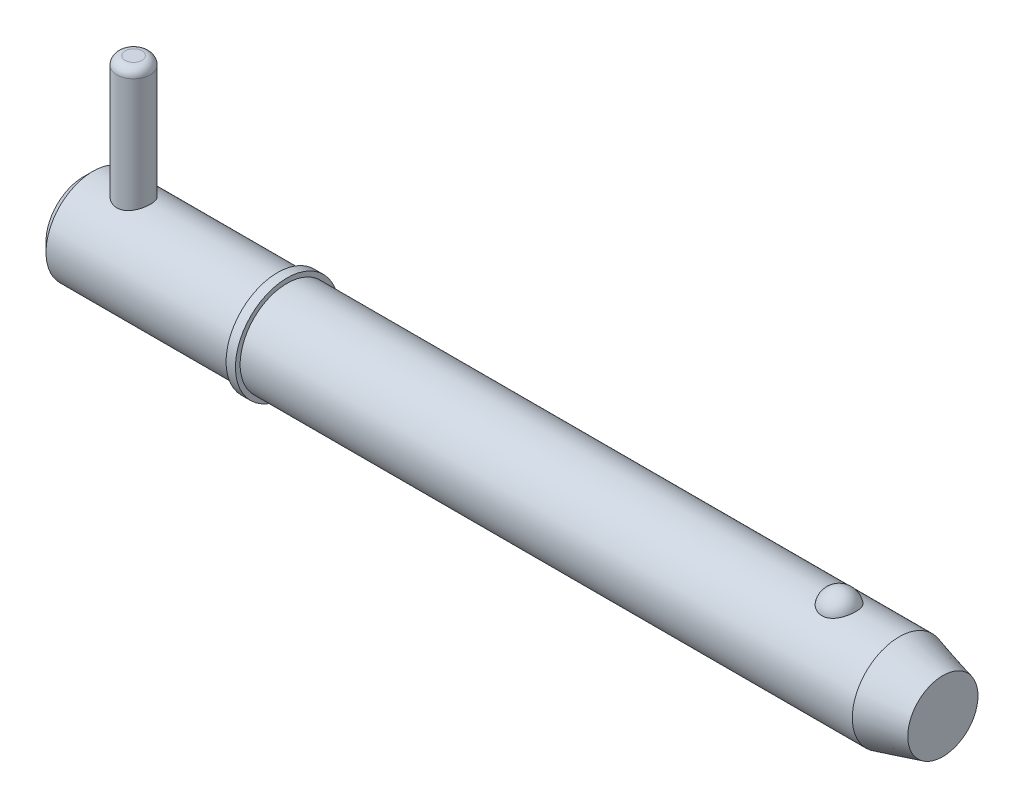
ISO-10303-21;
HEADER;
FILE_DESCRIPTION(('STEP AP214'),'2;1');
FILE_NAME('part.step','',(''),(''),'','','');
FILE_SCHEMA(('AUTOMOTIVE_DESIGN { 1 0 10303 214 1 1 1 1 }'));
ENDSEC;
DATA;
#1=APPLICATION_CONTEXT('core data for automotive mechanical design processes');
#2=APPLICATION_PROTOCOL_DEFINITION('international standard','automotive_design',2000,#1);
#3=PRODUCT_CONTEXT('',#1,'mechanical');
#4=PRODUCT('Part','Part','',(#3));
#5=PRODUCT_RELATED_PRODUCT_CATEGORY('part','',(#4));
#6=PRODUCT_DEFINITION_FORMATION('','',#4);
#7=PRODUCT_DEFINITION_CONTEXT('part definition',#1,'design');
#8=PRODUCT_DEFINITION('design','',#6,#7);
#9=PRODUCT_DEFINITION_SHAPE('','',#8);
#10=(LENGTH_UNIT() NAMED_UNIT(*) SI_UNIT(.MILLI.,.METRE.));
#11=(NAMED_UNIT(*) PLANE_ANGLE_UNIT() SI_UNIT($,.RADIAN.));
#12=(NAMED_UNIT(*) SI_UNIT($,.STERADIAN.) SOLID_ANGLE_UNIT());
#13=UNCERTAINTY_MEASURE_WITH_UNIT(LENGTH_MEASURE(1.E-05),#10,'distance_accuracy_value','');
#14=(GEOMETRIC_REPRESENTATION_CONTEXT(3) GLOBAL_UNCERTAINTY_ASSIGNED_CONTEXT((#13)) GLOBAL_UNIT_ASSIGNED_CONTEXT((#10,
#11,#12)) REPRESENTATION_CONTEXT('',''));
#15=CARTESIAN_POINT('',(0.,0.,0.));
#16=DIRECTION('',(0.,0.,1.));
#17=DIRECTION('',(1.,0.,0.));
#18=AXIS2_PLACEMENT_3D('',#15,#16,#17);
#19=CARTESIAN_POINT('',(5.94,19.845,0.));
#20=DIRECTION('',(0.,-1.,0.));
#21=DIRECTION('',(0.,0.,-1.));
#22=AXIS2_PLACEMENT_3D('',#19,#20,#21);
#23=CYLINDRICAL_SURFACE('',#22,1.98);
#24=CARTESIAN_POINT('',(5.94,-4.565,0.));
#25=DIRECTION('',(0.,1.,0.));
#26=DIRECTION('',(0.,0.,1.));
#27=AXIS2_PLACEMENT_3D('',#24,#25,#26);
#28=CIRCLE('',#27,1.98);
#29=CARTESIAN_POINT('',(5.94,-4.565,1.98));
#30=VERTEX_POINT('',#29);
#31=EDGE_CURVE('P0_E25',#30,#30,#28,.T.);
#32=ORIENTED_EDGE('',*,*,#31,.T.);
#33=EDGE_LOOP('',(#32));
#34=FACE_BOUND('',#33,.T.);
#35=CARTESIAN_POINT('',(5.94,18.855,0.));
#36=DIRECTION('',(0.,1.,0.));
#37=DIRECTION('',(0.,0.,1.));
#38=AXIS2_PLACEMENT_3D('',#35,#36,#37);
#39=CIRCLE('',#38,1.98);
#40=CARTESIAN_POINT('',(5.94,18.855,1.98));
#41=VERTEX_POINT('',#40);
#42=EDGE_CURVE('P0_E29',#41,#41,#39,.F.);
#43=ORIENTED_EDGE('',*,*,#42,.T.);
#44=EDGE_LOOP('',(#43));
#45=FACE_BOUND('',#44,.T.);
#46=ADVANCED_FACE('P0_F14',(#34,#45),#23,.T.);
#47=CARTESIAN_POINT('',(5.94,19.845,0.));
#48=DIRECTION('',(0.,1.,0.));
#49=DIRECTION('',(0.,0.,1.));
#50=AXIS2_PLACEMENT_3D('',#47,#48,#49);
#51=PLANE('',#50);
#52=CARTESIAN_POINT('',(5.94,19.845,0.));
#53=DIRECTION('',(0.,1.,0.));
#54=DIRECTION('',(0.,0.,1.));
#55=AXIS2_PLACEMENT_3D('',#52,#53,#54);
#56=CIRCLE('',#55,0.99);
#57=CARTESIAN_POINT('',(5.94,19.845,0.99));
#58=VERTEX_POINT('',#57);
#59=EDGE_CURVE('P0_E10',#58,#58,#56,.T.);
#60=ORIENTED_EDGE('',*,*,#59,.T.);
#61=EDGE_LOOP('',(#60));
#62=FACE_BOUND('',#61,.T.);
#63=ADVANCED_FACE('P0_F46',(#62),#51,.T.);
#64=CARTESIAN_POINT('',(5.94,-5.555,0.));
#65=DIRECTION('',(0.,1.,0.));
#66=DIRECTION('',(0.,0.,1.));
#67=AXIS2_PLACEMENT_3D('',#64,#65,#66);
#68=PLANE('',#67);
#69=CARTESIAN_POINT('',(5.94,-5.555,0.));
#70=DIRECTION('',(0.,1.,0.));
#71=DIRECTION('',(0.,0.,1.));
#72=AXIS2_PLACEMENT_3D('',#69,#70,#71);
#73=CIRCLE('',#72,0.99);
#74=CARTESIAN_POINT('',(5.94,-5.555,0.99));
#75=VERTEX_POINT('',#74);
#76=EDGE_CURVE('P0_E21',#75,#75,#73,.F.);
#77=ORIENTED_EDGE('',*,*,#76,.T.);
#78=EDGE_LOOP('',(#77));
#79=FACE_BOUND('',#78,.T.);
#80=ADVANCED_FACE('P0_F43',(#79),#68,.F.);
#81=CARTESIAN_POINT('',(5.94,-4.565,0.));
#82=DIRECTION('',(0.,1.,0.));
#83=DIRECTION('',(0.,0.,1.));
#84=AXIS2_PLACEMENT_3D('',#81,#82,#83);
#85=DEGENERATE_TOROIDAL_SURFACE('',#84,0.99,0.99,.T.);
#86=ORIENTED_EDGE('',*,*,#76,.F.);
#87=EDGE_LOOP('',(#86));
#88=FACE_BOUND('',#87,.T.);
#89=ORIENTED_EDGE('',*,*,#31,.F.);
#90=EDGE_LOOP('',(#89));
#91=FACE_BOUND('',#90,.T.);
#92=ADVANCED_FACE('P0_F38',(#88,#91),#85,.T.);
#93=CARTESIAN_POINT('',(5.94,18.855,0.));
#94=DIRECTION('',(0.,1.,0.));
#95=DIRECTION('',(0.,0.,1.));
#96=AXIS2_PLACEMENT_3D('',#93,#94,#95);
#97=DEGENERATE_TOROIDAL_SURFACE('',#96,0.99,0.99,.T.);
#98=ORIENTED_EDGE('',*,*,#42,.F.);
#99=EDGE_LOOP('',(#98));
#100=FACE_BOUND('',#99,.T.);
#101=ORIENTED_EDGE('',*,*,#59,.F.);
#102=EDGE_LOOP('',(#101));
#103=FACE_BOUND('',#102,.T.);
#104=ADVANCED_FACE('P0_F16',(#100,#103),#97,.T.);
#105=CLOSED_SHELL('',(#46,#63,#80,#92,#104));
#106=MANIFOLD_SOLID_BREP('P0_B1',#105);
#107=CARTESIAN_POINT('',(0.,0.,0.));
#108=DIRECTION('',(1.,0.,0.));
#109=DIRECTION('',(0.,0.,-1.));
#110=AXIS2_PLACEMENT_3D('',#107,#108,#109);
#111=CYLINDRICAL_SURFACE('',#110,5.555);
#112=CARTESIAN_POINT('',(96.7171144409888,0.,0.));
#113=DIRECTION('',(1.,0.,0.));
#114=DIRECTION('',(0.,0.,-1.));
#115=AXIS2_PLACEMENT_3D('',#112,#113,#114);
#116=CIRCLE('',#115,5.555);
#117=CARTESIAN_POINT('',(96.7171144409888,0.,-5.555));
#118=VERTEX_POINT('',#117);
#119=EDGE_CURVE('P1_E81',#118,#118,#116,.T.);
#120=ORIENTED_EDGE('',*,*,#119,.F.);
#121=EDGE_LOOP('',(#120));
#122=FACE_BOUND('',#121,.T.);
#123=CARTESIAN_POINT('',(24.13,0.,0.));
#124=DIRECTION('',(1.,0.,0.));
#125=DIRECTION('',(0.,0.,-1.));
#126=AXIS2_PLACEMENT_3D('',#123,#124,#125);
#127=CIRCLE('',#126,5.555);
#128=CARTESIAN_POINT('',(24.13,0.,-5.555));
#129=VERTEX_POINT('',#128);
#130=EDGE_CURVE('P1_E85',#129,#129,#127,.T.);
#131=ORIENTED_EDGE('',*,*,#130,.T.);
#132=EDGE_LOOP('',(#131));
#133=FACE_BOUND('',#132,.T.);
#134=CARTESIAN_POINT('',(89.5986264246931,5.16741224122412,2.03859650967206));
#135=CARTESIAN_POINT('',(89.4929492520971,5.16740893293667,2.03859990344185));
#136=CARTESIAN_POINT('',(89.3872989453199,5.17079470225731,2.03008306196));
#137=CARTESIAN_POINT('',(89.1791419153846,5.18392795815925,1.99630721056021));
#138=CARTESIAN_POINT('',(89.0766344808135,5.19367399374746,1.97105201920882));
#139=CARTESIAN_POINT('',(88.8777710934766,5.21839168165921,1.90463997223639));
#140=CARTESIAN_POINT('',(88.7814064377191,5.23335573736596,1.86350622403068));
#141=CARTESIAN_POINT('',(88.5970804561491,5.26688076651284,1.76652592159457));
#142=CARTESIAN_POINT('',(88.5091207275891,5.28544242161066,1.71067657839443));
#143=CARTESIAN_POINT('',(88.341265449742,5.32479845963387,1.58399959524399));
#144=CARTESIAN_POINT('',(88.2616656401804,5.34564089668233,1.51279545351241));
#145=CARTESIAN_POINT('',(88.1151290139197,5.38697258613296,1.3582858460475));
#146=CARTESIAN_POINT('',(88.048194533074,5.40746177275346,1.27497815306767));
#147=CARTESIAN_POINT('',(87.9256103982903,5.44694508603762,1.09440293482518));
#148=CARTESIAN_POINT('',(87.870598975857,5.46583143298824,0.996677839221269));
#149=CARTESIAN_POINT('',(87.7769376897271,5.49908030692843,0.792961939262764));
#150=CARTESIAN_POINT('',(87.7382894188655,5.513442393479,0.686970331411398));
#151=CARTESIAN_POINT('',(87.6776807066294,5.536358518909,0.468019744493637));
#152=CARTESIAN_POINT('',(87.6559725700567,5.54482455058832,0.354981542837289));
#153=CARTESIAN_POINT('',(87.6306362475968,5.55473324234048,0.126595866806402));
#154=CARTESIAN_POINT('',(87.6270077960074,5.55617600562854,0.0112484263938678));
#155=CARTESIAN_POINT('',(87.6378817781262,5.55189984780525,-0.218011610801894));
#156=CARTESIAN_POINT('',(87.6523151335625,5.54620821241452,-0.331928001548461));
#157=CARTESIAN_POINT('',(87.698903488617,5.52828920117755,-0.555544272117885));
#158=CARTESIAN_POINT('',(87.7310588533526,5.51606169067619,-0.665244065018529));
#159=CARTESIAN_POINT('',(87.8124883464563,5.48630779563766,-0.877469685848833));
#160=CARTESIAN_POINT('',(87.861781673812,5.4687754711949,-0.979987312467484));
#161=CARTESIAN_POINT('',(87.9764785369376,5.43024700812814,-1.17486975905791));
#162=CARTESIAN_POINT('',(88.0418831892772,5.40925062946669,-1.26723387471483));
#163=CARTESIAN_POINT('',(88.1875712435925,5.36600927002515,-1.43940133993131));
#164=CARTESIAN_POINT('',(88.2678859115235,5.34376173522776,-1.51917763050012));
#165=CARTESIAN_POINT('',(88.4414520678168,5.30057971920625,-1.66360338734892));
#166=CARTESIAN_POINT('',(88.534702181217,5.27964509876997,-1.72825445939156));
#167=CARTESIAN_POINT('',(88.7293939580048,5.24205250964,-1.83909478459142));
#168=CARTESIAN_POINT('',(88.8305900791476,5.22530519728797,-1.88568407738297));
#169=CARTESIAN_POINT('',(89.0401552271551,5.1975091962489,-1.96100802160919));
#170=CARTESIAN_POINT('',(89.1485215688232,5.1864583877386,-1.98974931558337));
#171=CARTESIAN_POINT('',(89.3634989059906,5.17184410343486,-2.02742262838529));
#172=CARTESIAN_POINT('',(89.469925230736,5.1679328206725,-2.03727608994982));
#173=CARTESIAN_POINT('',(89.6829925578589,5.16698995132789,-2.03966777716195));
#174=CARTESIAN_POINT('',(89.7896335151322,5.16995704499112,-2.03220932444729));
#175=CARTESIAN_POINT('',(89.9967730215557,5.18222383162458,-2.00071170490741));
#176=CARTESIAN_POINT('',(90.0973599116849,5.19133213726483,-1.97717337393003));
#177=CARTESIAN_POINT('',(90.2930141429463,5.21467637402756,-1.91475248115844));
#178=CARTESIAN_POINT('',(90.3880810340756,5.22891272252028,-1.87586867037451));
#179=CARTESIAN_POINT('',(90.5723711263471,5.26137066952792,-1.7828271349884));
#180=CARTESIAN_POINT('',(90.6614190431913,5.27967329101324,-1.72835124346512));
#181=CARTESIAN_POINT('',(90.8292880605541,5.3181741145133,-1.6059748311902));
#182=CARTESIAN_POINT('',(90.9081068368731,5.33837274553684,-1.53807126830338));
#183=CARTESIAN_POINT('',(91.0575156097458,5.37968287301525,-1.38688970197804));
#184=CARTESIAN_POINT('',(91.1275058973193,5.40079011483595,-1.30301744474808));
#185=CARTESIAN_POINT('',(91.2530125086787,5.44074401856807,-1.12458170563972));
#186=CARTESIAN_POINT('',(91.3085262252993,5.4595902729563,-1.03001630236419));
#187=CARTESIAN_POINT('',(91.4055507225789,5.49369849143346,-0.829439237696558));
#188=CARTESIAN_POINT('',(91.4465483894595,5.50882422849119,-0.723155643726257));
#189=CARTESIAN_POINT('',(91.5111250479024,5.53310911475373,-0.504772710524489));
#190=CARTESIAN_POINT('',(91.5347036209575,5.54226812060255,-0.392673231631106));
#191=CARTESIAN_POINT('',(91.564013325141,5.55370358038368,-0.165459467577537));
#192=CARTESIAN_POINT('',(91.5696884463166,5.55595843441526,-0.0503368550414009));
#193=CARTESIAN_POINT('',(91.562916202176,5.55329317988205,0.179288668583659));
#194=CARTESIAN_POINT('',(91.5504690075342,5.54837313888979,0.293791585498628));
#195=CARTESIAN_POINT('',(91.5077798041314,5.53189037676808,0.518526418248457));
#196=CARTESIAN_POINT('',(91.477598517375,5.5203503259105,0.628771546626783));
#197=CARTESIAN_POINT('',(91.4000962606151,5.49182453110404,0.842318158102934));
#198=CARTESIAN_POINT('',(91.3527743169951,5.47483847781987,0.945619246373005));
#199=CARTESIAN_POINT('',(91.2417204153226,5.43710633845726,1.14281571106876));
#200=CARTESIAN_POINT('',(91.1779215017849,5.41634501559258,1.23667048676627));
#201=CARTESIAN_POINT('',(91.0353577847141,5.37334572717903,1.41185243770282));
#202=CARTESIAN_POINT('',(90.9565932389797,5.35110778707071,1.4931798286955));
#203=CARTESIAN_POINT('',(90.7864234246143,5.30779474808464,1.64049162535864));
#204=CARTESIAN_POINT('',(90.6951002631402,5.28671324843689,1.70656877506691));
#205=CARTESIAN_POINT('',(90.5017390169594,5.24804852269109,1.82201372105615));
#206=CARTESIAN_POINT('',(90.3997005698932,5.23046541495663,1.87138095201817));
#207=CARTESIAN_POINT('',(90.1836187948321,5.20042692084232,1.95335298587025));
#208=CARTESIAN_POINT('',(90.069260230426,5.18820192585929,1.98521734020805));
#209=CARTESIAN_POINT('',(89.8361307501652,5.17169804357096,2.02783294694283));
#210=CARTESIAN_POINT('',(89.7173616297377,5.16741595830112,2.03859269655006));
#211=CARTESIAN_POINT('',(89.5986264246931,5.16741224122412,2.03859650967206));
#212=B_SPLINE_CURVE_WITH_KNOTS('',3,(#134,#135,#136,#137,#138,#139,#140,#141,#142,#143,#144,
#145,#146,#147,#148,#149,#150,#151,#152,#153,#154,#155,#156,#157,#158,#159,#160,#161,#162,#163,
#164,#165,#166,#167,#168,#169,#170,#171,#172,#173,#174,#175,#176,#177,#178,#179,#180,#181,#182,
#183,#184,#185,#186,#187,#188,#189,#190,#191,#192,#193,#194,#195,#196,#197,#198,#199,#200,#201,
#202,#203,#204,#205,#206,#207,#208,#209,#210,#211),.UNSPECIFIED.,.T.,.F.,(4,2,2,2,2,2,2,2,2,2,2,
2,2,2,2,2,2,2,2,2,2,2,2,2,2,2,2,2,2,2,2,2,2,2,2,2,2,2,4),(0.,0.316595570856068,
0.633118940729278,0.949183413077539,1.26530783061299,1.59030762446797,1.91536729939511,
2.25495824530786,2.5945822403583,2.93917283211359,3.28375835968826,3.62703002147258,
3.97030875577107,4.31397329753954,4.65766166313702,5.0020790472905,5.34645984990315,
5.68270547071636,6.01882587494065,6.33808403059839,6.65728093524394,6.96696376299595,
7.27667180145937,7.59321535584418,7.90983070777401,8.24210387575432,8.57443684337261,
8.91755896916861,9.26068933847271,9.60489211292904,9.94909164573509,10.2921194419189,
10.6351667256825,10.9796305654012,11.3240884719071,11.6663928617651,12.0087088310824,
12.3645679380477,12.7202837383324),.UNSPECIFIED.);
#213=CARTESIAN_POINT('',(89.5986264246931,5.16741224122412,2.03859650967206));
#214=VERTEX_POINT('',#213);
#215=EDGE_CURVE('P1_E35',#214,#214,#212,.T.);
#216=ORIENTED_EDGE('',*,*,#215,.T.);
#217=EDGE_LOOP('',(#216));
#218=FACE_BOUND('',#217,.T.);
#219=ADVANCED_FACE('P1_F13',(#122,#133,#218),#111,.T.);
#220=CARTESIAN_POINT('',(0.,0.,0.));
#221=DIRECTION('',(-1.,0.,0.));
#222=DIRECTION('',(0.,0.,1.));
#223=AXIS2_PLACEMENT_3D('',#220,#221,#222);
#224=PLANE('',#223);
#225=CARTESIAN_POINT('',(0.,0.,0.));
#226=DIRECTION('',(1.,0.,0.));
#227=DIRECTION('',(0.,0.,-1.));
#228=AXIS2_PLACEMENT_3D('',#225,#226,#227);
#229=CIRCLE('',#228,4.444);
#230=CARTESIAN_POINT('',(0.,0.,-4.444));
#231=VERTEX_POINT('',#230);
#232=EDGE_CURVE('P1_E9',#231,#231,#229,.T.);
#233=ORIENTED_EDGE('',*,*,#232,.F.);
#234=EDGE_LOOP('',(#233));
#235=FACE_BOUND('',#234,.T.);
#236=ADVANCED_FACE('P1_F15',(#235),#224,.T.);
#237=CARTESIAN_POINT('',(1.111,0.,0.));
#238=DIRECTION('',(1.,0.,0.));
#239=DIRECTION('',(0.,0.,-1.));
#240=AXIS2_PLACEMENT_3D('',#237,#238,#239);
#241=CONICAL_SURFACE('',#240,5.555,0.78539816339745);
#242=ORIENTED_EDGE('',*,*,#232,.T.);
#243=EDGE_LOOP('',(#242));
#244=FACE_BOUND('',#243,.T.);
#245=CARTESIAN_POINT('',(1.111,0.,0.));
#246=DIRECTION('',(1.,0.,0.));
#247=DIRECTION('',(0.,0.,-1.));
#248=AXIS2_PLACEMENT_3D('',#245,#246,#247);
#249=CIRCLE('',#248,5.555);
#250=CARTESIAN_POINT('',(1.111,0.,-5.555));
#251=VERTEX_POINT('',#250);
#252=EDGE_CURVE('P1_E26',#251,#251,#249,.T.);
#253=ORIENTED_EDGE('',*,*,#252,.F.);
#254=EDGE_LOOP('',(#253));
#255=FACE_BOUND('',#254,.T.);
#256=ADVANCED_FACE('P1_F77',(#244,#255),#241,.T.);
#257=CARTESIAN_POINT('',(0.,0.,0.));
#258=DIRECTION('',(1.,0.,0.));
#259=DIRECTION('',(0.,0.,-1.));
#260=AXIS2_PLACEMENT_3D('',#257,#258,#259);
#261=CYLINDRICAL_SURFACE('',#260,5.555);
#262=CARTESIAN_POINT('',(5.94,-5.19014691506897,1.98));
#263=CARTESIAN_POINT('',(5.83264687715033,-5.19014494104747,1.98000226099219));
#264=CARTESIAN_POINT('',(5.7253094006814,-5.19351395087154,1.97123988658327));
#265=CARTESIAN_POINT('',(5.51384517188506,-5.20654291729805,1.93656219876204));
#266=CARTESIAN_POINT('',(5.40971858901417,-5.21620320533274,1.91064598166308));
#267=CARTESIAN_POINT('',(5.20778082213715,-5.24058443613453,1.84271148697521));
#268=CARTESIAN_POINT('',(5.10995634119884,-5.25529427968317,1.80072850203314));
#269=CARTESIAN_POINT('',(4.92270352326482,-5.28810012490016,1.70197537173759));
#270=CARTESIAN_POINT('',(4.83327743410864,-5.3061970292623,1.64520128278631));
#271=CARTESIAN_POINT('',(4.66135184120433,-5.34464714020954,1.51575187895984));
#272=CARTESIAN_POINT('',(4.57928277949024,-5.36506222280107,1.44252311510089));
#273=CARTESIAN_POINT('',(4.42829115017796,-5.40532920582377,1.28342047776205));
#274=CARTESIAN_POINT('',(4.35937105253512,-5.42518099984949,1.19754423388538));
#275=CARTESIAN_POINT('',(4.23461605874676,-5.46281133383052,1.01237205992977));
#276=CARTESIAN_POINT('',(4.17924129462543,-5.48050875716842,0.912748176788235));
#277=CARTESIAN_POINT('',(4.0862117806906,-5.51109938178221,0.70485824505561));
#278=CARTESIAN_POINT('',(4.0485515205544,-5.52399407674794,0.596594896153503));
#279=CARTESIAN_POINT('',(3.99350662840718,-5.54308759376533,0.379019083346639));
#280=CARTESIAN_POINT('',(3.97538263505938,-5.54952987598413,0.269915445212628));
#281=CARTESIAN_POINT('',(3.95756405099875,-5.55586205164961,0.0500378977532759));
#282=CARTESIAN_POINT('',(3.95786404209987,-5.55575387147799,-0.060735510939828));
#283=CARTESIAN_POINT('',(3.97643665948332,-5.54915684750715,-0.275539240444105));
#284=CARTESIAN_POINT('',(3.99390415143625,-5.54295384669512,-0.379649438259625));
#285=CARTESIAN_POINT('',(4.0449721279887,-5.52523170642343,-0.583350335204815));
#286=CARTESIAN_POINT('',(4.07857373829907,-5.51371219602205,-0.682940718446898));
#287=CARTESIAN_POINT('',(4.16137312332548,-5.4863099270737,-0.876423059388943));
#288=CARTESIAN_POINT('',(4.2107826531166,-5.47036834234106,-0.970215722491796));
#289=CARTESIAN_POINT('',(4.32361427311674,-5.43575653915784,-1.1484017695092));
#290=CARTESIAN_POINT('',(4.38704062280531,-5.41708549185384,-1.23279228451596));
#291=CARTESIAN_POINT('',(4.53006791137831,-5.37778429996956,-1.39454579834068));
#292=CARTESIAN_POINT('',(4.61035105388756,-5.35710277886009,-1.4712940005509));
#293=CARTESIAN_POINT('',(4.78279835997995,-5.31692766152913,-1.6104545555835));
#294=CARTESIAN_POINT('',(4.874964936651,-5.29743430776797,-1.67286398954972));
#295=CARTESIAN_POINT('',(5.07076688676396,-5.26153775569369,-1.78259698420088));
#296=CARTESIAN_POINT('',(5.17458163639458,-5.24519780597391,-1.8296227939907));
#297=CARTESIAN_POINT('',(5.38938990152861,-5.21818744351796,-1.90530278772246));
#298=CARTESIAN_POINT('',(5.50037985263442,-5.20751423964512,-1.93396601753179));
#299=CARTESIAN_POINT('',(5.72036376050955,-5.19369176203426,-1.97077654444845));
#300=CARTESIAN_POINT('',(5.82917370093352,-5.19018851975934,-1.97989015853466));
#301=CARTESIAN_POINT('',(6.04680100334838,-5.19010609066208,-1.98010779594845));
#302=CARTESIAN_POINT('',(6.15561835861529,-5.19352540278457,-1.97121572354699));
#303=CARTESIAN_POINT('',(6.36548036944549,-5.20654623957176,-1.93654727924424));
#304=CARTESIAN_POINT('',(6.46666051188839,-5.21588705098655,-1.91148218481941));
#305=CARTESIAN_POINT('',(6.66334537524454,-5.23939939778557,-1.84605494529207));
#306=CARTESIAN_POINT('',(6.75884899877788,-5.25357186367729,-1.8056898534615));
#307=CARTESIAN_POINT('',(6.94517989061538,-5.28576258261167,-1.70921153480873));
#308=CARTESIAN_POINT('',(7.03572661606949,-5.30389804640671,-1.65259670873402));
#309=CARTESIAN_POINT('',(7.20638087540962,-5.34176077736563,-1.52577523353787));
#310=CARTESIAN_POINT('',(7.28648490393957,-5.36148857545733,-1.45556404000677));
#311=CARTESIAN_POINT('',(7.43864697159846,-5.40165494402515,-1.2988614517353));
#312=CARTESIAN_POINT('',(7.50999887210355,-5.42207106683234,-1.21167640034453));
#313=CARTESIAN_POINT('',(7.63712639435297,-5.46023601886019,-1.026066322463));
#314=CARTESIAN_POINT('',(7.69290228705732,-5.47798489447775,-0.927641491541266));
#315=CARTESIAN_POINT('',(7.78684673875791,-5.50876590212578,-0.722633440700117));
#316=CARTESIAN_POINT('',(7.82510508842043,-5.52182201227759,-0.616095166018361));
#317=CARTESIAN_POINT('',(7.88297051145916,-5.54184206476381,-0.397530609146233));
#318=CARTESIAN_POINT('',(7.90258540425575,-5.5488085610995,-0.285506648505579));
#319=CARTESIAN_POINT('',(7.9218262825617,-5.55564472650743,-0.065566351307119));
#320=CARTESIAN_POINT('',(7.92245987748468,-5.55587212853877,0.0422515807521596));
#321=CARTESIAN_POINT('',(7.90626329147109,-5.55011340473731,0.256387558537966));
#322=CARTESIAN_POINT('',(7.88943488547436,-5.54412791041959,0.362705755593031));
#323=CARTESIAN_POINT('',(7.83948457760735,-5.52676548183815,0.568649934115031));
#324=CARTESIAN_POINT('',(7.8067003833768,-5.51550046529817,0.668367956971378));
#325=CARTESIAN_POINT('',(7.72609369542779,-5.48874437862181,0.860911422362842));
#326=CARTESIAN_POINT('',(7.67826838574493,-5.47325251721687,0.953735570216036));
#327=CARTESIAN_POINT('',(7.56675024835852,-5.43884382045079,1.13391068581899));
#328=CARTESIAN_POINT('',(7.50249968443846,-5.41981485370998,1.22089468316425));
#329=CARTESIAN_POINT('',(7.36086495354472,-5.38069275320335,1.38316665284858));
#330=CARTESIAN_POINT('',(7.28347630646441,-5.36059925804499,1.45845061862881));
#331=CARTESIAN_POINT('',(7.11347587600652,-5.32048380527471,1.59876646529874));
#332=CARTESIAN_POINT('',(7.02032386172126,-5.30050854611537,1.66315951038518));
#333=CARTESIAN_POINT('',(6.82388804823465,-5.26398994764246,1.77536801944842));
#334=CARTESIAN_POINT('',(6.7206049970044,-5.24744635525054,1.82318470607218));
#335=CARTESIAN_POINT('',(6.50639706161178,-5.21987969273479,1.90068230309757));
#336=CARTESIAN_POINT('',(6.3954529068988,-5.20887116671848,1.93031547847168));
#337=CARTESIAN_POINT('',(6.16966522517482,-5.19400760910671,1.96996824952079));
#338=CARTESIAN_POINT('',(6.05482366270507,-5.19014902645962,1.97999758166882));
#339=CARTESIAN_POINT('',(5.94,-5.19014691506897,1.98));
#340=B_SPLINE_CURVE_WITH_KNOTS('',3,(#262,#263,#264,#265,#266,#267,#268,#269,#270,#271,#272,
#273,#274,#275,#276,#277,#278,#279,#280,#281,#282,#283,#284,#285,#286,#287,#288,#289,#290,#291,
#292,#293,#294,#295,#296,#297,#298,#299,#300,#301,#302,#303,#304,#305,#306,#307,#308,#309,#310,
#311,#312,#313,#314,#315,#316,#317,#318,#319,#320,#321,#322,#323,#324,#325,#326,#327,#328,#329,
#330,#331,#332,#333,#334,#335,#336,#337,#338,#339),.UNSPECIFIED.,.T.,.F.,(4,2,2,2,2,2,2,2,2,2,2,
2,2,2,2,2,2,2,2,2,2,2,2,2,2,2,2,2,2,2,2,2,2,2,2,2,2,2,4),(0.,0.321632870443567,
0.643282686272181,0.964229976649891,1.28526292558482,1.61937087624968,1.9535415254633,
2.29784481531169,2.64204093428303,2.97269632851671,3.30325448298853,3.61901541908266,
3.93479838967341,4.25500220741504,4.57530346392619,4.91268648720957,5.25013812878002,
5.59378026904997,5.93725299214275,6.26331481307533,6.58930593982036,6.90185604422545,
7.21446637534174,7.53801472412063,7.86167140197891,8.20353561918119,8.54539388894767,
8.88547970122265,9.22542281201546,9.54728637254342,9.86911722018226,10.1844146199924,
10.4997710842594,10.827730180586,11.1558013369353,11.499115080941,11.8424034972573,
12.1865892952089,12.5306041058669),.UNSPECIFIED.);
#341=CARTESIAN_POINT('',(5.94,-5.19014691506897,1.98));
#342=VERTEX_POINT('',#341);
#343=EDGE_CURVE('P1_E17',#342,#342,#340,.T.);
#344=ORIENTED_EDGE('',*,*,#343,.F.);
#345=EDGE_LOOP('',(#344));
#346=FACE_BOUND('',#345,.T.);
#347=CARTESIAN_POINT('',(5.94,5.19014691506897,1.98));
#348=CARTESIAN_POINT('',(6.04735312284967,5.19014494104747,1.98000226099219));
#349=CARTESIAN_POINT('',(6.1546905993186,5.19351395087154,1.97123988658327));
#350=CARTESIAN_POINT('',(6.36615482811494,5.20654291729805,1.93656219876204));
#351=CARTESIAN_POINT('',(6.47028141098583,5.21620320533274,1.91064598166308));
#352=CARTESIAN_POINT('',(6.67221917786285,5.24058443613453,1.84271148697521));
#353=CARTESIAN_POINT('',(6.77004365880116,5.25529427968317,1.80072850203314));
#354=CARTESIAN_POINT('',(6.95729647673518,5.28810012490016,1.70197537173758));
#355=CARTESIAN_POINT('',(7.04672256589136,5.3061970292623,1.64520128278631));
#356=CARTESIAN_POINT('',(7.21864815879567,5.34464714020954,1.51575187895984));
#357=CARTESIAN_POINT('',(7.30071722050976,5.36506222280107,1.44252311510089));
#358=CARTESIAN_POINT('',(7.45170884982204,5.40532920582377,1.28342047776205));
#359=CARTESIAN_POINT('',(7.52062894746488,5.42518099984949,1.19754423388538));
#360=CARTESIAN_POINT('',(7.64538394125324,5.46281133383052,1.01237205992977));
#361=CARTESIAN_POINT('',(7.70075870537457,5.48050875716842,0.912748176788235));
#362=CARTESIAN_POINT('',(7.7937882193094,5.51109938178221,0.704858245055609));
#363=CARTESIAN_POINT('',(7.8314484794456,5.52399407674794,0.596594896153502));
#364=CARTESIAN_POINT('',(7.88649337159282,5.54308759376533,0.379019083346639));
#365=CARTESIAN_POINT('',(7.90461736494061,5.54952987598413,0.269915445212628));
#366=CARTESIAN_POINT('',(7.92243594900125,5.55586205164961,0.0500378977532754));
#367=CARTESIAN_POINT('',(7.92213595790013,5.55575387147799,-0.0607355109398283));
#368=CARTESIAN_POINT('',(7.90356334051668,5.54915684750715,-0.275539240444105));
#369=CARTESIAN_POINT('',(7.88609584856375,5.54295384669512,-0.379649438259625));
#370=CARTESIAN_POINT('',(7.8350278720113,5.52523170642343,-0.583350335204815));
#371=CARTESIAN_POINT('',(7.80142626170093,5.51371219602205,-0.682940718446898));
#372=CARTESIAN_POINT('',(7.71862687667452,5.4863099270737,-0.876423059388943));
#373=CARTESIAN_POINT('',(7.6692173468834,5.47036834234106,-0.970215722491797));
#374=CARTESIAN_POINT('',(7.55638572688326,5.43575653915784,-1.1484017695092));
#375=CARTESIAN_POINT('',(7.49295937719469,5.41708549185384,-1.23279228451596));
#376=CARTESIAN_POINT('',(7.34993208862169,5.37778429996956,-1.39454579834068));
#377=CARTESIAN_POINT('',(7.26964894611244,5.35710277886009,-1.4712940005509));
#378=CARTESIAN_POINT('',(7.09720164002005,5.31692766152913,-1.6104545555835));
#379=CARTESIAN_POINT('',(7.00503506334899,5.29743430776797,-1.67286398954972));
#380=CARTESIAN_POINT('',(6.80923311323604,5.26153775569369,-1.78259698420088));
#381=CARTESIAN_POINT('',(6.70541836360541,5.24519780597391,-1.8296227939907));
#382=CARTESIAN_POINT('',(6.49061009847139,5.21818744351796,-1.90530278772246));
#383=CARTESIAN_POINT('',(6.37962014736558,5.20751423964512,-1.93396601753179));
#384=CARTESIAN_POINT('',(6.15963623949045,5.19369176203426,-1.97077654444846));
#385=CARTESIAN_POINT('',(6.05082629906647,5.19018851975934,-1.97989015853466));
#386=CARTESIAN_POINT('',(5.83319899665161,5.19010609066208,-1.98010779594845));
#387=CARTESIAN_POINT('',(5.7243816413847,5.19352540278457,-1.97121572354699));
#388=CARTESIAN_POINT('',(5.5145196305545,5.20654623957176,-1.93654727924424));
#389=CARTESIAN_POINT('',(5.4133394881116,5.21588705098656,-1.91148218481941));
#390=CARTESIAN_POINT('',(5.21665462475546,5.23939939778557,-1.84605494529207));
#391=CARTESIAN_POINT('',(5.12115100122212,5.25357186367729,-1.8056898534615));
#392=CARTESIAN_POINT('',(4.93482010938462,5.28576258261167,-1.70921153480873));
#393=CARTESIAN_POINT('',(4.84427338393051,5.30389804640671,-1.65259670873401));
#394=CARTESIAN_POINT('',(4.67361912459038,5.34176077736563,-1.52577523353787));
#395=CARTESIAN_POINT('',(4.59351509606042,5.36148857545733,-1.45556404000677));
#396=CARTESIAN_POINT('',(4.44135302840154,5.40165494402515,-1.2988614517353));
#397=CARTESIAN_POINT('',(4.37000112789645,5.42207106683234,-1.21167640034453));
#398=CARTESIAN_POINT('',(4.24287360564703,5.46023601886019,-1.026066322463));
#399=CARTESIAN_POINT('',(4.18709771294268,5.47798489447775,-0.927641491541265));
#400=CARTESIAN_POINT('',(4.09315326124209,5.50876590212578,-0.722633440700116));
#401=CARTESIAN_POINT('',(4.05489491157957,5.52182201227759,-0.61609516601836));
#402=CARTESIAN_POINT('',(3.99702948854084,5.54184206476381,-0.397530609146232));
#403=CARTESIAN_POINT('',(3.97741459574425,5.5488085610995,-0.285506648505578));
#404=CARTESIAN_POINT('',(3.9581737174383,5.55564472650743,-0.0655663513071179));
#405=CARTESIAN_POINT('',(3.95754012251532,5.55587212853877,0.0422515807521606));
#406=CARTESIAN_POINT('',(3.97373670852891,5.55011340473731,0.256387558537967));
#407=CARTESIAN_POINT('',(3.99056511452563,5.54412791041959,0.362705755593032));
#408=CARTESIAN_POINT('',(4.04051542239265,5.52676548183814,0.568649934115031));
#409=CARTESIAN_POINT('',(4.07329961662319,5.51550046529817,0.668367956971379));
#410=CARTESIAN_POINT('',(4.15390630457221,5.48874437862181,0.860911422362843));
#411=CARTESIAN_POINT('',(4.20173161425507,5.47325251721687,0.953735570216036));
#412=CARTESIAN_POINT('',(4.31324975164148,5.43884382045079,1.13391068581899));
#413=CARTESIAN_POINT('',(4.37750031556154,5.41981485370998,1.22089468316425));
#414=CARTESIAN_POINT('',(4.51913504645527,5.38069275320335,1.38316665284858));
#415=CARTESIAN_POINT('',(4.59652369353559,5.36059925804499,1.45845061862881));
#416=CARTESIAN_POINT('',(4.76652412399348,5.32048380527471,1.59876646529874));
#417=CARTESIAN_POINT('',(4.85967613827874,5.30050854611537,1.66315951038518));
#418=CARTESIAN_POINT('',(5.05611195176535,5.26398994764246,1.77536801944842));
#419=CARTESIAN_POINT('',(5.1593950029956,5.24744635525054,1.82318470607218));
#420=CARTESIAN_POINT('',(5.37360293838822,5.21987969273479,1.90068230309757));
#421=CARTESIAN_POINT('',(5.4845470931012,5.20887116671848,1.93031547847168));
#422=CARTESIAN_POINT('',(5.71033477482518,5.19400760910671,1.96996824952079));
#423=CARTESIAN_POINT('',(5.82517633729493,5.19014902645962,1.97999758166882));
#424=CARTESIAN_POINT('',(5.94,5.19014691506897,1.98));
#425=B_SPLINE_CURVE_WITH_KNOTS('',3,(#347,#348,#349,#350,#351,#352,#353,#354,#355,#356,#357,
#358,#359,#360,#361,#362,#363,#364,#365,#366,#367,#368,#369,#370,#371,#372,#373,#374,#375,#376,
#377,#378,#379,#380,#381,#382,#383,#384,#385,#386,#387,#388,#389,#390,#391,#392,#393,#394,#395,
#396,#397,#398,#399,#400,#401,#402,#403,#404,#405,#406,#407,#408,#409,#410,#411,#412,#413,#414,
#415,#416,#417,#418,#419,#420,#421,#422,#423,#424),.UNSPECIFIED.,.T.,.F.,(4,2,2,2,2,2,2,2,2,2,2,
2,2,2,2,2,2,2,2,2,2,2,2,2,2,2,2,2,2,2,2,2,2,2,2,2,2,2,4),(0.,0.321632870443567,
0.643282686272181,0.964229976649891,1.28526292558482,1.61937087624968,1.9535415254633,
2.29784481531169,2.64204093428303,2.97269632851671,3.30325448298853,3.61901541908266,
3.93479838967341,4.25500220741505,4.57530346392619,4.91268648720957,5.25013812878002,
5.59378026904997,5.93725299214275,6.26331481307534,6.58930593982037,6.90185604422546,
7.21446637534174,7.53801472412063,7.86167140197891,8.20353561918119,8.54539388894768,
8.88547970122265,9.22542281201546,9.54728637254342,9.86911722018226,10.1844146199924,
10.4997710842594,10.827730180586,11.1558013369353,11.499115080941,11.8424034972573,
12.1865892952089,12.5306041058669),.UNSPECIFIED.);
#426=CARTESIAN_POINT('',(5.94,5.19014691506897,1.98));
#427=VERTEX_POINT('',#426);
#428=EDGE_CURVE('P1_E43',#427,#427,#425,.T.);
#429=ORIENTED_EDGE('',*,*,#428,.F.);
#430=EDGE_LOOP('',(#429));
#431=FACE_BOUND('',#430,.T.);
#432=ORIENTED_EDGE('',*,*,#252,.T.);
#433=EDGE_LOOP('',(#432));
#434=FACE_BOUND('',#433,.T.);
#435=CARTESIAN_POINT('',(23.019,0.,0.));
#436=DIRECTION('',(1.,0.,0.));
#437=DIRECTION('',(0.,0.,-1.));
#438=AXIS2_PLACEMENT_3D('',#435,#436,#437);
#439=CIRCLE('',#438,5.555);
#440=CARTESIAN_POINT('',(23.019,0.,-5.555));
#441=VERTEX_POINT('',#440);
#442=EDGE_CURVE('P1_E31',#441,#441,#439,.T.);
#443=ORIENTED_EDGE('',*,*,#442,.F.);
#444=EDGE_LOOP('',(#443));
#445=FACE_BOUND('',#444,.T.);
#446=ADVANCED_FACE('P1_F103',(#346,#431,#434,#445),#261,.T.);
#447=CARTESIAN_POINT('',(23.019,5.555,0.));
#448=DIRECTION('',(-1.,0.,0.));
#449=DIRECTION('',(0.,0.,1.));
#450=AXIS2_PLACEMENT_3D('',#447,#448,#449);
#451=PLANE('',#450);
#452=ORIENTED_EDGE('',*,*,#442,.T.);
#453=EDGE_LOOP('',(#452));
#454=FACE_BOUND('',#453,.T.);
#455=CARTESIAN_POINT('',(23.019,0.,0.));
#456=DIRECTION('',(1.,0.,0.));
#457=DIRECTION('',(0.,0.,-1.));
#458=AXIS2_PLACEMENT_3D('',#455,#456,#457);
#459=CIRCLE('',#458,6.1105);
#460=CARTESIAN_POINT('',(23.019,0.,-6.1105));
#461=VERTEX_POINT('',#460);
#462=EDGE_CURVE('P1_E91',#461,#461,#459,.T.);
#463=ORIENTED_EDGE('',*,*,#462,.F.);
#464=EDGE_LOOP('',(#463));
#465=FACE_BOUND('',#464,.T.);
#466=ADVANCED_FACE('P1_F100',(#454,#465),#451,.T.);
#467=CARTESIAN_POINT('',(0.,0.,0.));
#468=DIRECTION('',(1.,0.,0.));
#469=DIRECTION('',(0.,0.,-1.));
#470=AXIS2_PLACEMENT_3D('',#467,#468,#469);
#471=CYLINDRICAL_SURFACE('',#470,6.1105);
#472=ORIENTED_EDGE('',*,*,#462,.T.);
#473=EDGE_LOOP('',(#472));
#474=FACE_BOUND('',#473,.T.);
#475=CARTESIAN_POINT('',(24.13,0.,0.));
#476=DIRECTION('',(1.,0.,0.));
#477=DIRECTION('',(0.,0.,-1.));
#478=AXIS2_PLACEMENT_3D('',#475,#476,#477);
#479=CIRCLE('',#478,6.1105);
#480=CARTESIAN_POINT('',(24.13,0.,-6.1105));
#481=VERTEX_POINT('',#480);
#482=EDGE_CURVE('P1_E88',#481,#481,#479,.T.);
#483=ORIENTED_EDGE('',*,*,#482,.F.);
#484=EDGE_LOOP('',(#483));
#485=FACE_BOUND('',#484,.T.);
#486=ADVANCED_FACE('P1_F68',(#474,#485),#471,.T.);
#487=CARTESIAN_POINT('',(24.13,6.1105,0.));
#488=DIRECTION('',(1.,0.,0.));
#489=DIRECTION('',(0.,0.,-1.));
#490=AXIS2_PLACEMENT_3D('',#487,#488,#489);
#491=PLANE('',#490);
#492=ORIENTED_EDGE('',*,*,#482,.T.);
#493=EDGE_LOOP('',(#492));
#494=FACE_BOUND('',#493,.T.);
#495=ORIENTED_EDGE('',*,*,#130,.F.);
#496=EDGE_LOOP('',(#495));
#497=FACE_BOUND('',#496,.T.);
#498=ADVANCED_FACE('P1_F62',(#494,#497),#491,.T.);
#499=CARTESIAN_POINT('',(101.9,0.,0.));
#500=DIRECTION('',(-1.,0.,0.));
#501=DIRECTION('',(0.,0.,1.));
#502=AXIS2_PLACEMENT_3D('',#499,#500,#501);
#503=CONICAL_SURFACE('',#502,4.16625000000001,0.26179938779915);
#504=ORIENTED_EDGE('',*,*,#119,.T.);
#505=EDGE_LOOP('',(#504));
#506=FACE_BOUND('',#505,.T.);
#507=CARTESIAN_POINT('',(101.9,0.,0.));
#508=DIRECTION('',(1.,0.,0.));
#509=DIRECTION('',(0.,0.,-1.));
#510=AXIS2_PLACEMENT_3D('',#507,#508,#509);
#511=CIRCLE('',#510,4.16625000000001);
#512=CARTESIAN_POINT('',(101.9,0.,-4.16625000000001));
#513=VERTEX_POINT('',#512);
#514=EDGE_CURVE('P1_E42',#513,#513,#511,.T.);
#515=ORIENTED_EDGE('',*,*,#514,.F.);
#516=EDGE_LOOP('',(#515));
#517=FACE_BOUND('',#516,.T.);
#518=ADVANCED_FACE('P1_F59',(#506,#517),#503,.T.);
#519=CARTESIAN_POINT('',(101.9,4.16625000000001,0.));
#520=DIRECTION('',(1.,0.,0.));
#521=DIRECTION('',(0.,0.,-1.));
#522=AXIS2_PLACEMENT_3D('',#519,#520,#521);
#523=PLANE('',#522);
#524=ORIENTED_EDGE('',*,*,#514,.T.);
#525=EDGE_LOOP('',(#524));
#526=FACE_BOUND('',#525,.T.);
#527=ADVANCED_FACE('P1_F55',(#526),#523,.T.);
#528=CARTESIAN_POINT('',(89.5986264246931,4.9995,0.));
#529=DIRECTION('',(-1.,0.,0.));
#530=DIRECTION('',(0.,1.,0.));
#531=AXIS2_PLACEMENT_3D('',#528,#529,#530);
#532=SPHERICAL_SURFACE('',#531,2.04550000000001);
#533=ORIENTED_EDGE('',*,*,#215,.F.);
#534=EDGE_LOOP('',(#533));
#535=FACE_BOUND('',#534,.T.);
#536=ADVANCED_FACE('P1_F50',(#535),#532,.T.);
#537=CARTESIAN_POINT('',(5.94,-6.1105,0.));
#538=DIRECTION('',(0.,1.,0.));
#539=DIRECTION('',(0.,0.,1.));
#540=AXIS2_PLACEMENT_3D('',#537,#538,#539);
#541=CYLINDRICAL_SURFACE('',#540,1.98);
#542=ORIENTED_EDGE('',*,*,#343,.T.);
#543=EDGE_LOOP('',(#542));
#544=FACE_BOUND('',#543,.T.);
#545=ORIENTED_EDGE('',*,*,#428,.T.);
#546=EDGE_LOOP('',(#545));
#547=FACE_BOUND('',#546,.T.);
#548=ADVANCED_FACE('P1_F54',(#544,#547),#541,.F.);
#549=CLOSED_SHELL('',(#219,#236,#256,#446,#466,#486,#498,#518,#527,#536,#548));
#550=MANIFOLD_SOLID_BREP('P1_B1',#549);
#551=ADVANCED_BREP_SHAPE_REPRESENTATION('',(#18,#106,#550),#14);
#552=SHAPE_DEFINITION_REPRESENTATION(#9,#551);
ENDSEC;
END-ISO-10303-21;
